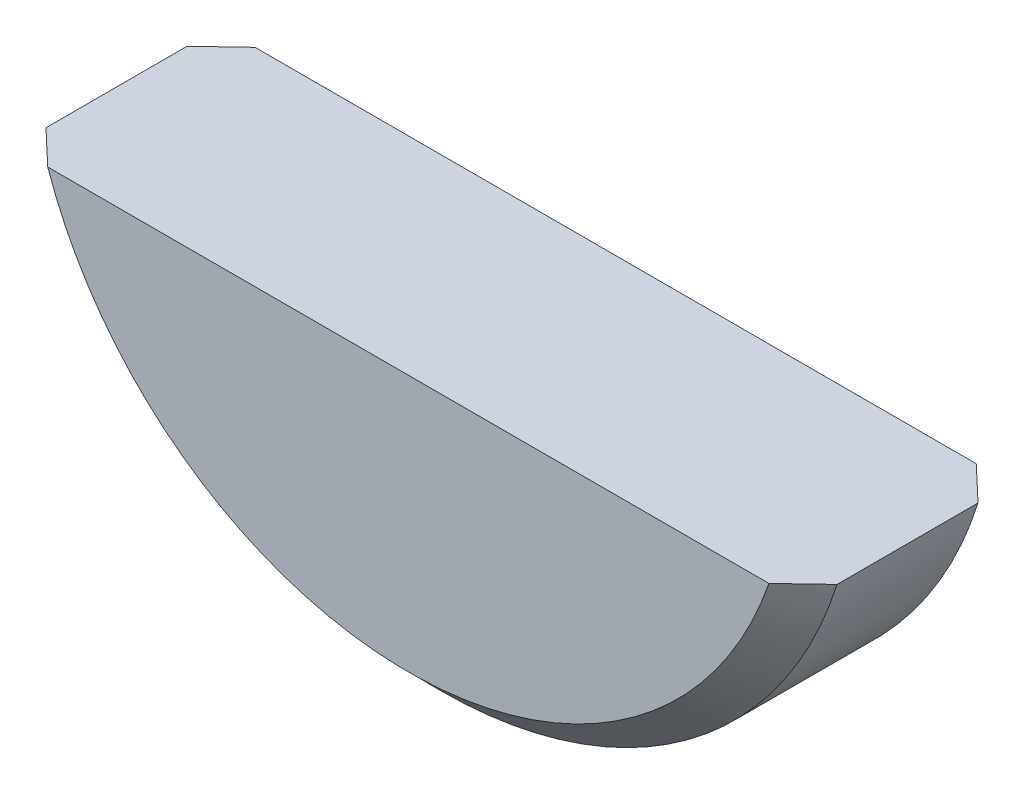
from build123d import *

# Parameters (mm, degrees)
EXTRUDE1_DEPTH = 1
CHAMFER1_SIZE  = 0.16


with BuildPart() as part:
    # Sketch1 → Extrude1 (new body)
    with BuildSketch(Plane.XY):
        with BuildLine():
            Line((-1.907878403, 0), (1.907878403, 0))
            ThreePointArc((1.907878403, 0), (0, -1.4), (-1.907878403, 0))
        make_face()
    extrude(amount=EXTRUDE1_DEPTH)

    # Chamfer1
    chamfer1_edges = [part.edges().sort_by_distance(p)[0] for p in [
        (0, -1.4, 0),
        (0, -1.4, 1),
    ]]
    chamfer(chamfer1_edges, length=CHAMFER1_SIZE)


solid = part.part
